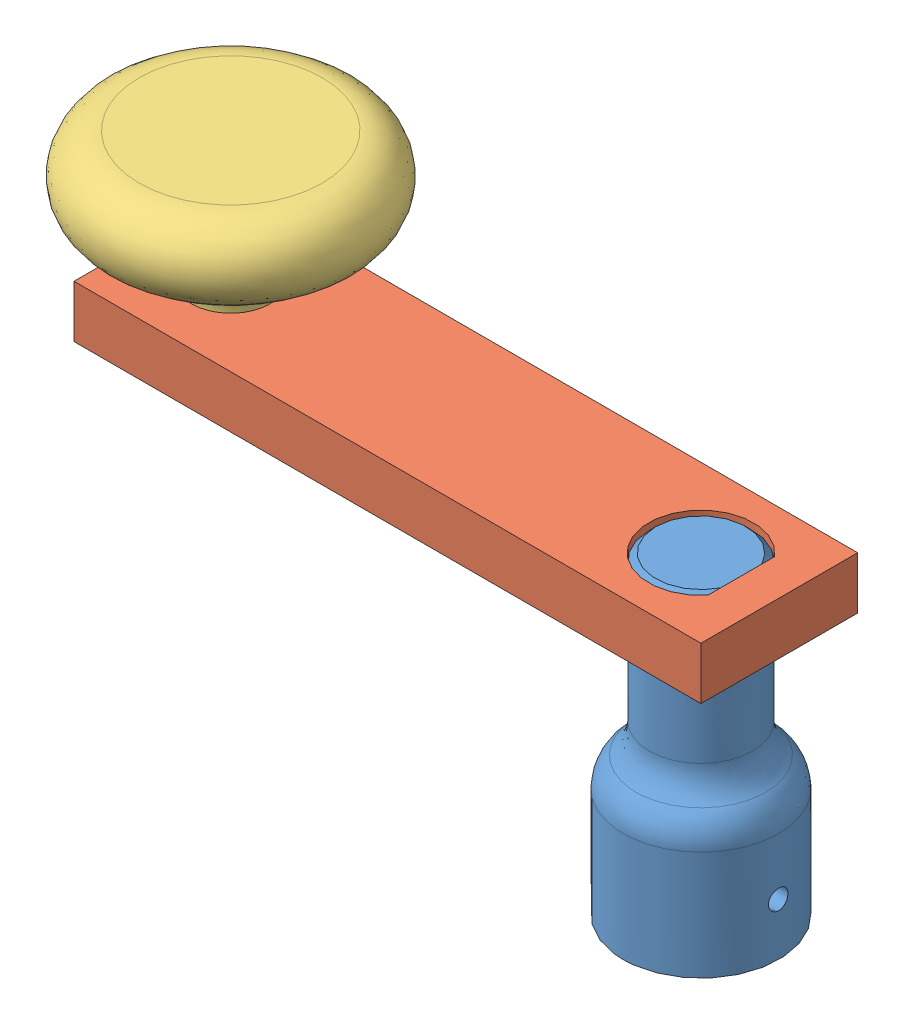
SolidWorks assembly crank sub.SLDASM, configuration Default (file format 13000). Lengths in mm.
Overall size (88.68 53.98 44.01).
3 component instances, 3 part files, 5 mates.
Components (placement in the parent):
- crank-shaft-1: crank-shaft.sldprt [Default] at origin size (18.92 38.1 18.92)
- crank-arm-1: crank-arm.sldprt [Default] at (-66.675 31.75 -9.525) size (76.2 6.35 19.05)
- crank-knob-1: crank-knob.sldprt [Default] at (-57.15 31.75 0) x (0.8335 0 0.55252) z (-0.55252 0 0.8335) size (31.75 22.23 31.75)
Mates (geometry in assembly coordinates):
- Concentric1: concentric: cylinder of crank-shaft-1 through (0 38.1 0) axis (0 -1 0) radius 6.2865; cylinder of crank-arm-1 through (0 31.75 0) axis (0 1 0) radius 6.35
- Parallel1: parallel: plane of crank-shaft-1 through (4.8895 31.75 3.9513) normal (1 0 0); plane of crank-arm-1 through (4.8895 31.75 -4.0516) normal (-1 0 0)
- Coincident2: coincident: plane of crank-shaft-1 through (0 31.75 0) normal (0 1 0); line of crank-arm-1 through (9.525 31.75 9.525) axis (0 0 -1)
- Concentric2: concentric: cylinder of crank-arm-1 through (-57.15 31.75 0) axis (0 1 0) radius 2.3813; cylinder of crank-knob-1 through (-57.15 31.75 0) axis (0 -1 0) radius 2.286
- Coincident3: coincident: plane of crank-arm-1 through (9.525 38.1 9.525) normal (0 1 0); plane of crank-knob-1 through (-53.1805 38.1 2.6314) normal (0 -1 0)
